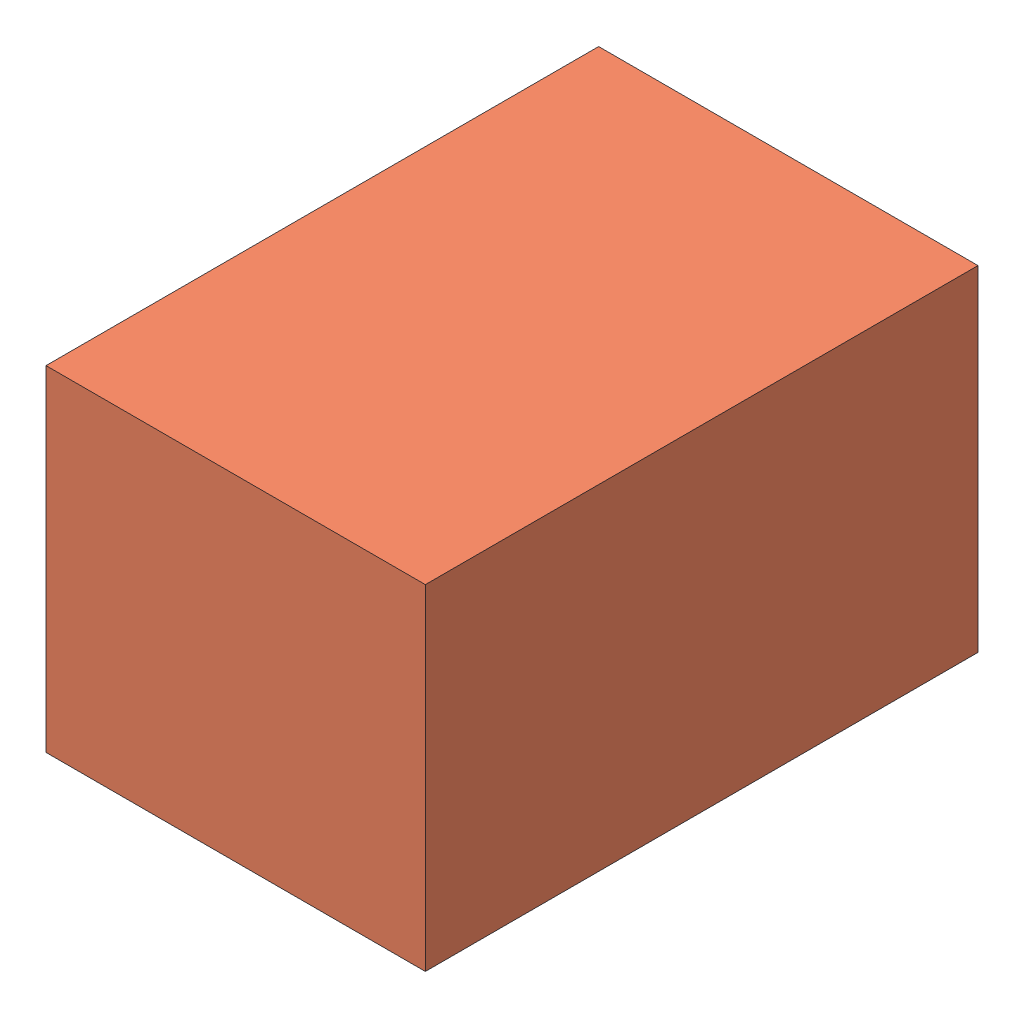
SolidWorks assembly Assem1.SLDASM, configuration Default (file format 9000). Lengths in mm.
Overall size (205.93 181.87 300).
2 component instances, 2 part files, 1 mates.
Components (placement in the parent):
- model1-1: model1.SLDPRT [Default] at origin size (122.4 122.4 163.2)
- body-1: body.SLDPRT [Default] at (0 0 -153.4) size (205.93 181.87 300)
Mates (geometry in assembly coordinates):
- ProfileCenter1: profile center = 65 mm aligned: plane of body-1 through (0 0 146.6) normal (0 0 1); plane of model1-1 through (0 0 81.6) normal (0 0 1)
